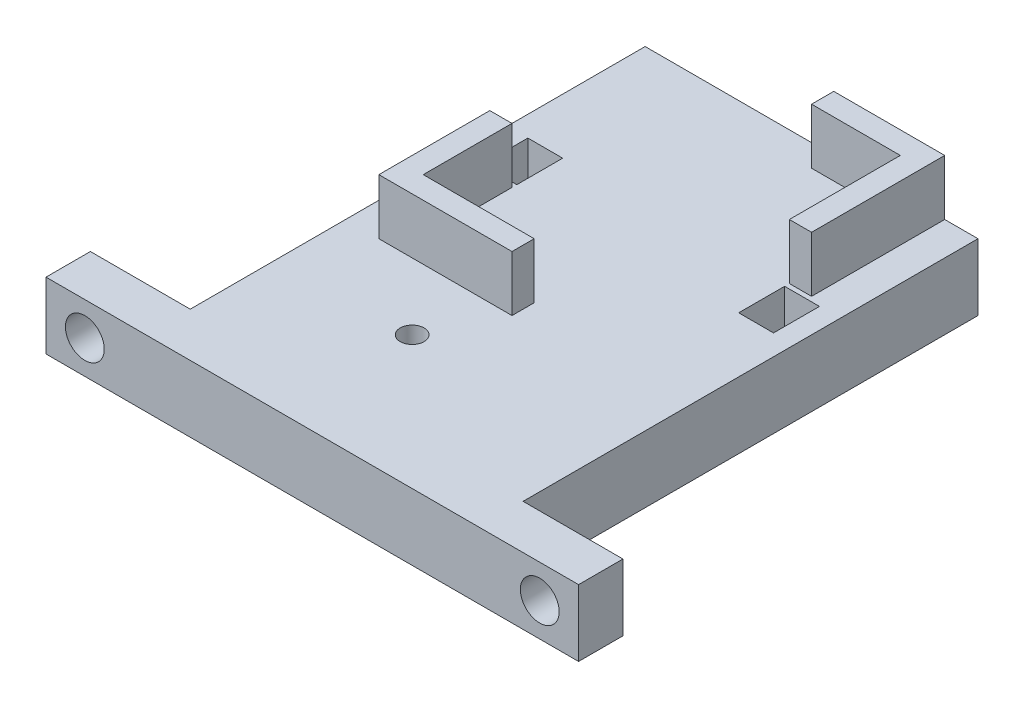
ISO-10303-21;
HEADER;
FILE_DESCRIPTION(('STEP AP214'),'2;1');
FILE_NAME('part.step','',(''),(''),'','','');
FILE_SCHEMA(('AUTOMOTIVE_DESIGN { 1 0 10303 214 1 1 1 1 }'));
ENDSEC;
DATA;
#1=APPLICATION_CONTEXT('core data for automotive mechanical design processes');
#2=APPLICATION_PROTOCOL_DEFINITION('international standard','automotive_design',2000,#1);
#3=PRODUCT_CONTEXT('',#1,'mechanical');
#4=PRODUCT('Part','Part','',(#3));
#5=PRODUCT_RELATED_PRODUCT_CATEGORY('part','',(#4));
#6=PRODUCT_DEFINITION_FORMATION('','',#4);
#7=PRODUCT_DEFINITION_CONTEXT('part definition',#1,'design');
#8=PRODUCT_DEFINITION('design','',#6,#7);
#9=PRODUCT_DEFINITION_SHAPE('','',#8);
#10=(LENGTH_UNIT() NAMED_UNIT(*) SI_UNIT(.MILLI.,.METRE.));
#11=(NAMED_UNIT(*) PLANE_ANGLE_UNIT() SI_UNIT($,.RADIAN.));
#12=(NAMED_UNIT(*) SI_UNIT($,.STERADIAN.) SOLID_ANGLE_UNIT());
#13=UNCERTAINTY_MEASURE_WITH_UNIT(LENGTH_MEASURE(1.E-05),#10,'distance_accuracy_value','');
#14=(GEOMETRIC_REPRESENTATION_CONTEXT(3) GLOBAL_UNCERTAINTY_ASSIGNED_CONTEXT((#13)) GLOBAL_UNIT_ASSIGNED_CONTEXT((#10,
#11,#12)) REPRESENTATION_CONTEXT('',''));
#15=CARTESIAN_POINT('',(0.,0.,0.));
#16=DIRECTION('',(0.,0.,1.));
#17=DIRECTION('',(1.,0.,0.));
#18=AXIS2_PLACEMENT_3D('',#15,#16,#17);
#19=CARTESIAN_POINT('',(-15.,6.,-22.5));
#20=DIRECTION('',(1.,0.,0.));
#21=DIRECTION('',(0.,0.,-1.));
#22=AXIS2_PLACEMENT_3D('',#19,#20,#21);
#23=PLANE('',#22);
#24=DIRECTION('',(0.,0.,1.));
#25=VECTOR('',#24,1.);
#26=CARTESIAN_POINT('',(-15.,0.,-22.5));
#27=LINE('',#26,#25);
#28=CARTESIAN_POINT('',(-15.,0.,-22.5));
#29=VERTEX_POINT('',#28);
#30=CARTESIAN_POINT('',(-15.,0.,18.5));
#31=VERTEX_POINT('',#30);
#32=EDGE_CURVE('E530',#29,#31,#27,.T.);
#33=ORIENTED_EDGE('',*,*,#32,.T.);
#34=DIRECTION('',(0.,1.,0.));
#35=VECTOR('',#34,1.);
#36=CARTESIAN_POINT('',(-15.,6.,18.5));
#37=LINE('',#36,#35);
#38=CARTESIAN_POINT('',(-15.,6.,18.5));
#39=VERTEX_POINT('',#38);
#40=EDGE_CURVE('E354',#31,#39,#37,.T.);
#41=ORIENTED_EDGE('',*,*,#40,.T.);
#42=DIRECTION('',(0.,0.,1.));
#43=VECTOR('',#42,1.);
#44=CARTESIAN_POINT('',(-15.,6.,-22.5));
#45=LINE('',#44,#43);
#46=CARTESIAN_POINT('',(-15.,6.,-22.5));
#47=VERTEX_POINT('',#46);
#48=EDGE_CURVE('E531',#47,#39,#45,.T.);
#49=ORIENTED_EDGE('',*,*,#48,.F.);
#50=DIRECTION('',(0.,-1.,0.));
#51=VECTOR('',#50,1.);
#52=CARTESIAN_POINT('',(-15.,6.,-22.5));
#53=LINE('',#52,#51);
#54=EDGE_CURVE('E55',#47,#29,#53,.T.);
#55=ORIENTED_EDGE('',*,*,#54,.T.);
#56=EDGE_LOOP('',(#33,#41,#49,#55));
#57=FACE_BOUND('',#56,.T.);
#58=ADVANCED_FACE('F47',(#57),#23,.F.);
#59=CARTESIAN_POINT('',(-15.,6.,22.5));
#60=DIRECTION('',(0.,0.,-1.));
#61=DIRECTION('',(-1.,0.,0.));
#62=AXIS2_PLACEMENT_3D('',#59,#60,#61);
#63=PLANE('',#62);
#64=DIRECTION('',(1.,0.,0.));
#65=VECTOR('',#64,1.);
#66=CARTESIAN_POINT('',(-15.,0.,22.5));
#67=LINE('',#66,#65);
#68=CARTESIAN_POINT('',(-24.,0.,22.5));
#69=VERTEX_POINT('',#68);
#70=CARTESIAN_POINT('',(24.,0.,22.5));
#71=VERTEX_POINT('',#70);
#72=EDGE_CURVE('E545',#69,#71,#67,.T.);
#73=ORIENTED_EDGE('',*,*,#72,.T.);
#74=DIRECTION('',(0.,1.,0.));
#75=VECTOR('',#74,1.);
#76=CARTESIAN_POINT('',(24.,6.,22.5));
#77=LINE('',#76,#75);
#78=CARTESIAN_POINT('',(24.,6.,22.5));
#79=VERTEX_POINT('',#78);
#80=EDGE_CURVE('E330',#71,#79,#77,.T.);
#81=ORIENTED_EDGE('',*,*,#80,.T.);
#82=DIRECTION('',(1.,0.,0.));
#83=VECTOR('',#82,1.);
#84=CARTESIAN_POINT('',(-15.,6.,22.5));
#85=LINE('',#84,#83);
#86=CARTESIAN_POINT('',(-24.,6.,22.5));
#87=VERTEX_POINT('',#86);
#88=EDGE_CURVE('E534',#87,#79,#85,.T.);
#89=ORIENTED_EDGE('',*,*,#88,.F.);
#90=DIRECTION('',(0.,-1.,0.));
#91=VECTOR('',#90,1.);
#92=CARTESIAN_POINT('',(-24.,6.,22.5));
#93=LINE('',#92,#91);
#94=EDGE_CURVE('E351',#87,#69,#93,.T.);
#95=ORIENTED_EDGE('',*,*,#94,.T.);
#96=EDGE_LOOP('',(#73,#81,#89,#95));
#97=FACE_BOUND('',#96,.T.);
#98=CARTESIAN_POINT('',(-20.5,3.,22.5));
#99=DIRECTION('',(0.,0.,1.));
#100=DIRECTION('',(1.,0.,0.));
#101=AXIS2_PLACEMENT_3D('',#98,#99,#100);
#102=CIRCLE('',#101,1.75);
#103=CARTESIAN_POINT('',(-18.75,3.,22.5));
#104=VERTEX_POINT('',#103);
#105=EDGE_CURVE('E345',#104,#104,#102,.T.);
#106=ORIENTED_EDGE('',*,*,#105,.F.);
#107=EDGE_LOOP('',(#106));
#108=FACE_BOUND('',#107,.T.);
#109=CARTESIAN_POINT('',(20.5,3.,22.5));
#110=DIRECTION('',(0.,0.,1.));
#111=DIRECTION('',(-1.,0.,0.));
#112=AXIS2_PLACEMENT_3D('',#109,#110,#111);
#113=CIRCLE('',#112,1.75);
#114=CARTESIAN_POINT('',(18.75,3.,22.5));
#115=VERTEX_POINT('',#114);
#116=EDGE_CURVE('E342',#115,#115,#113,.T.);
#117=ORIENTED_EDGE('',*,*,#116,.F.);
#118=EDGE_LOOP('',(#117));
#119=FACE_BOUND('',#118,.T.);
#120=ADVANCED_FACE('F593',(#97,#108,#119),#63,.F.);
#121=CARTESIAN_POINT('',(15.,6.,-22.5));
#122=DIRECTION('',(-1.,0.,0.));
#123=DIRECTION('',(0.,0.,1.));
#124=AXIS2_PLACEMENT_3D('',#121,#122,#123);
#125=PLANE('',#124);
#126=DIRECTION('',(0.,0.,-1.));
#127=VECTOR('',#126,1.);
#128=CARTESIAN_POINT('',(15.,6.,-22.5));
#129=LINE('',#128,#127);
#130=CARTESIAN_POINT('',(15.,6.,18.5));
#131=VERTEX_POINT('',#130);
#132=CARTESIAN_POINT('',(15.,6.,-22.5));
#133=VERTEX_POINT('',#132);
#134=EDGE_CURVE('E537',#131,#133,#129,.T.);
#135=ORIENTED_EDGE('',*,*,#134,.F.);
#136=DIRECTION('',(0.,-1.,0.));
#137=VECTOR('',#136,1.);
#138=CARTESIAN_POINT('',(15.,6.,18.5));
#139=LINE('',#138,#137);
#140=CARTESIAN_POINT('',(15.,0.,18.5));
#141=VERTEX_POINT('',#140);
#142=EDGE_CURVE('E334',#131,#141,#139,.T.);
#143=ORIENTED_EDGE('',*,*,#142,.T.);
#144=DIRECTION('',(0.,0.,-1.));
#145=VECTOR('',#144,1.);
#146=CARTESIAN_POINT('',(15.,0.,-22.5));
#147=LINE('',#146,#145);
#148=CARTESIAN_POINT('',(15.,0.,-22.5));
#149=VERTEX_POINT('',#148);
#150=EDGE_CURVE('E547',#141,#149,#147,.T.);
#151=ORIENTED_EDGE('',*,*,#150,.T.);
#152=DIRECTION('',(0.,-1.,0.));
#153=VECTOR('',#152,1.);
#154=CARTESIAN_POINT('',(15.,6.,-22.5));
#155=LINE('',#154,#153);
#156=EDGE_CURVE('E11',#133,#149,#155,.T.);
#157=ORIENTED_EDGE('',*,*,#156,.F.);
#158=EDGE_LOOP('',(#135,#143,#151,#157));
#159=FACE_BOUND('',#158,.T.);
#160=ADVANCED_FACE('F588',(#159),#125,.F.);
#161=CARTESIAN_POINT('',(-15.,6.,-22.5));
#162=DIRECTION('',(0.,0.,1.));
#163=DIRECTION('',(1.,0.,0.));
#164=AXIS2_PLACEMENT_3D('',#161,#162,#163);
#165=PLANE('',#164);
#166=DIRECTION('',(-1.,0.,0.));
#167=VECTOR('',#166,1.);
#168=CARTESIAN_POINT('',(-15.,0.,-22.5));
#169=LINE('',#168,#167);
#170=EDGE_CURVE('E535',#149,#29,#169,.T.);
#171=ORIENTED_EDGE('',*,*,#170,.T.);
#172=ORIENTED_EDGE('',*,*,#54,.F.);
#173=DIRECTION('',(-1.,0.,0.));
#174=VECTOR('',#173,1.);
#175=CARTESIAN_POINT('',(-15.,6.,-22.5));
#176=LINE('',#175,#174);
#177=CARTESIAN_POINT('',(1.99999999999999,6.,-22.5));
#178=VERTEX_POINT('',#177);
#179=EDGE_CURVE('E539',#178,#47,#176,.T.);
#180=ORIENTED_EDGE('',*,*,#179,.F.);
#181=DIRECTION('',(0.,-1.,0.));
#182=VECTOR('',#181,1.);
#183=CARTESIAN_POINT('',(1.99999999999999,11.,-22.5));
#184=LINE('',#183,#182);
#185=CARTESIAN_POINT('',(1.99999999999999,11.,-22.5));
#186=VERTEX_POINT('',#185);
#187=EDGE_CURVE('E469',#186,#178,#184,.T.);
#188=ORIENTED_EDGE('',*,*,#187,.F.);
#189=DIRECTION('',(-1.,0.,0.));
#190=VECTOR('',#189,1.);
#191=CARTESIAN_POINT('',(0.,11.,-22.5));
#192=LINE('',#191,#190);
#193=CARTESIAN_POINT('',(12.,11.,-22.5));
#194=VERTEX_POINT('',#193);
#195=EDGE_CURVE('E471',#194,#186,#192,.T.);
#196=ORIENTED_EDGE('',*,*,#195,.F.);
#197=DIRECTION('',(0.,-1.,0.));
#198=VECTOR('',#197,1.);
#199=CARTESIAN_POINT('',(12.,11.,-22.5));
#200=LINE('',#199,#198);
#201=CARTESIAN_POINT('',(12.,6.,-22.5));
#202=VERTEX_POINT('',#201);
#203=EDGE_CURVE('E466',#194,#202,#200,.T.);
#204=ORIENTED_EDGE('',*,*,#203,.T.);
#205=EDGE_CURVE('E540',#133,#202,#176,.T.);
#206=ORIENTED_EDGE('',*,*,#205,.F.);
#207=ORIENTED_EDGE('',*,*,#156,.T.);
#208=EDGE_LOOP('',(#171,#172,#180,#188,#196,#204,#206,#207));
#209=FACE_BOUND('',#208,.T.);
#210=ADVANCED_FACE('F570',(#209),#165,.F.);
#211=CARTESIAN_POINT('',(0.,6.,0.));
#212=DIRECTION('',(0.,1.,0.));
#213=DIRECTION('',(0.,0.,1.));
#214=AXIS2_PLACEMENT_3D('',#211,#212,#213);
#215=PLANE('',#214);
#216=CARTESIAN_POINT('',(-3.,6.,10.5));
#217=DIRECTION('',(0.,1.,0.));
#218=DIRECTION('',(0.,0.,1.));
#219=AXIS2_PLACEMENT_3D('',#216,#217,#218);
#220=CIRCLE('',#219,1.075);
#221=CARTESIAN_POINT('',(-3.,6.,11.575));
#222=VERTEX_POINT('',#221);
#223=EDGE_CURVE('E50',#222,#222,#220,.T.);
#224=ORIENTED_EDGE('',*,*,#223,.F.);
#225=EDGE_LOOP('',(#224));
#226=FACE_BOUND('',#225,.T.);
#227=DIRECTION('',(0.,0.,1.));
#228=VECTOR('',#227,1.);
#229=CARTESIAN_POINT('',(-13.14,6.,-5.92999999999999));
#230=LINE('',#229,#228);
#231=CARTESIAN_POINT('',(-13.14,6.,-10.07));
#232=VERTEX_POINT('',#231);
#233=CARTESIAN_POINT('',(-13.14,6.,-5.92999999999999));
#234=VERTEX_POINT('',#233);
#235=EDGE_CURVE('E389',#232,#234,#230,.T.);
#236=ORIENTED_EDGE('',*,*,#235,.F.);
#237=DIRECTION('',(-1.,0.,0.));
#238=VECTOR('',#237,1.);
#239=CARTESIAN_POINT('',(-13.14,6.,-10.07));
#240=LINE('',#239,#238);
#241=CARTESIAN_POINT('',(-10.,6.,-10.07));
#242=VERTEX_POINT('',#241);
#243=EDGE_CURVE('E379',#242,#232,#240,.T.);
#244=ORIENTED_EDGE('',*,*,#243,.F.);
#245=DIRECTION('',(0.,0.,-1.));
#246=VECTOR('',#245,1.);
#247=CARTESIAN_POINT('',(-10.,6.,-5.92999999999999));
#248=LINE('',#247,#246);
#249=CARTESIAN_POINT('',(-10.,6.,-5.92999999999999));
#250=VERTEX_POINT('',#249);
#251=EDGE_CURVE('E395',#250,#242,#248,.T.);
#252=ORIENTED_EDGE('',*,*,#251,.F.);
#253=DIRECTION('',(1.,0.,0.));
#254=VECTOR('',#253,1.);
#255=CARTESIAN_POINT('',(-13.14,6.,-5.92999999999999));
#256=LINE('',#255,#254);
#257=EDGE_CURVE('E391',#234,#250,#256,.T.);
#258=ORIENTED_EDGE('',*,*,#257,.F.);
#259=EDGE_LOOP('',(#236,#244,#252,#258));
#260=FACE_BOUND('',#259,.T.);
#261=DIRECTION('',(0.,0.,-1.));
#262=VECTOR('',#261,1.);
#263=CARTESIAN_POINT('',(13.14,6.,-5.92999999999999));
#264=LINE('',#263,#262);
#265=CARTESIAN_POINT('',(13.14,6.,-5.92999999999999));
#266=VERTEX_POINT('',#265);
#267=CARTESIAN_POINT('',(13.14,6.,-10.07));
#268=VERTEX_POINT('',#267);
#269=EDGE_CURVE('E392',#266,#268,#264,.T.);
#270=ORIENTED_EDGE('',*,*,#269,.F.);
#271=DIRECTION('',(1.,0.,0.));
#272=VECTOR('',#271,1.);
#273=CARTESIAN_POINT('',(13.14,6.,-5.92999999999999));
#274=LINE('',#273,#272);
#275=CARTESIAN_POINT('',(10.,6.,-5.92999999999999));
#276=VERTEX_POINT('',#275);
#277=EDGE_CURVE('E418',#276,#266,#274,.T.);
#278=ORIENTED_EDGE('',*,*,#277,.F.);
#279=DIRECTION('',(0.,0.,1.));
#280=VECTOR('',#279,1.);
#281=CARTESIAN_POINT('',(10.,6.,-5.92999999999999));
#282=LINE('',#281,#280);
#283=CARTESIAN_POINT('',(10.,6.,-10.07));
#284=VERTEX_POINT('',#283);
#285=EDGE_CURVE('E421',#284,#276,#282,.T.);
#286=ORIENTED_EDGE('',*,*,#285,.F.);
#287=DIRECTION('',(-1.,0.,0.));
#288=VECTOR('',#287,1.);
#289=CARTESIAN_POINT('',(13.14,6.,-10.07));
#290=LINE('',#289,#288);
#291=EDGE_CURVE('E425',#268,#284,#290,.T.);
#292=ORIENTED_EDGE('',*,*,#291,.F.);
#293=EDGE_LOOP('',(#270,#278,#286,#292));
#294=FACE_BOUND('',#293,.T.);
#295=DIRECTION('',(0.,0.,-1.));
#296=VECTOR('',#295,1.);
#297=CARTESIAN_POINT('',(1.99999999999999,6.,0.));
#298=LINE('',#297,#296);
#299=CARTESIAN_POINT('',(1.99999999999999,6.,-20.5));
#300=VERTEX_POINT('',#299);
#301=EDGE_CURVE('E445',#300,#178,#298,.T.);
#302=ORIENTED_EDGE('',*,*,#301,.T.);
#303=ORIENTED_EDGE('',*,*,#179,.T.);
#304=ORIENTED_EDGE('',*,*,#48,.T.);
#305=DIRECTION('',(-1.,0.,0.));
#306=VECTOR('',#305,1.);
#307=CARTESIAN_POINT('',(-15.,6.,18.5));
#308=LINE('',#307,#306);
#309=CARTESIAN_POINT('',(-24.,6.,18.5));
#310=VERTEX_POINT('',#309);
#311=EDGE_CURVE('E357',#39,#310,#308,.T.);
#312=ORIENTED_EDGE('',*,*,#311,.T.);
#313=DIRECTION('',(0.,0.,1.));
#314=VECTOR('',#313,1.);
#315=CARTESIAN_POINT('',(-24.,6.,18.5));
#316=LINE('',#315,#314);
#317=EDGE_CURVE('E366',#310,#87,#316,.T.);
#318=ORIENTED_EDGE('',*,*,#317,.T.);
#319=ORIENTED_EDGE('',*,*,#88,.T.);
#320=DIRECTION('',(0.,0.,1.));
#321=VECTOR('',#320,1.);
#322=CARTESIAN_POINT('',(24.,6.,18.5));
#323=LINE('',#322,#321);
#324=CARTESIAN_POINT('',(24.,6.,18.5));
#325=VERTEX_POINT('',#324);
#326=EDGE_CURVE('E316',#325,#79,#323,.T.);
#327=ORIENTED_EDGE('',*,*,#326,.F.);
#328=DIRECTION('',(-1.,0.,0.));
#329=VECTOR('',#328,1.);
#330=CARTESIAN_POINT('',(15.,6.,18.5));
#331=LINE('',#330,#329);
#332=EDGE_CURVE('E327',#325,#131,#331,.T.);
#333=ORIENTED_EDGE('',*,*,#332,.T.);
#334=ORIENTED_EDGE('',*,*,#134,.T.);
#335=ORIENTED_EDGE('',*,*,#205,.T.);
#336=DIRECTION('',(0.,0.,1.));
#337=VECTOR('',#336,1.);
#338=CARTESIAN_POINT('',(12.,6.,-20.5));
#339=LINE('',#338,#337);
#340=CARTESIAN_POINT('',(12.,6.,-10.5));
#341=VERTEX_POINT('',#340);
#342=EDGE_CURVE('E448',#202,#341,#339,.T.);
#343=ORIENTED_EDGE('',*,*,#342,.T.);
#344=DIRECTION('',(-1.,0.,0.));
#345=VECTOR('',#344,1.);
#346=CARTESIAN_POINT('',(12.,6.,-10.5));
#347=LINE('',#346,#345);
#348=CARTESIAN_POINT('',(10.,6.,-10.5));
#349=VERTEX_POINT('',#348);
#350=EDGE_CURVE('E451',#341,#349,#347,.T.);
#351=ORIENTED_EDGE('',*,*,#350,.T.);
#352=DIRECTION('',(0.,0.,1.));
#353=VECTOR('',#352,1.);
#354=CARTESIAN_POINT('',(9.99999999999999,6.,-20.5));
#355=LINE('',#354,#353);
#356=CARTESIAN_POINT('',(9.99999999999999,6.,-20.5));
#357=VERTEX_POINT('',#356);
#358=EDGE_CURVE('E455',#357,#349,#355,.T.);
#359=ORIENTED_EDGE('',*,*,#358,.F.);
#360=DIRECTION('',(-1.,0.,0.));
#361=VECTOR('',#360,1.);
#362=CARTESIAN_POINT('',(0.,6.,-20.5));
#363=LINE('',#362,#361);
#364=EDGE_CURVE('E472',#357,#300,#363,.T.);
#365=ORIENTED_EDGE('',*,*,#364,.T.);
#366=EDGE_LOOP('',(#302,#303,#304,#312,#318,#319,#327,#333,#334,#335,#343,#351,#359,#365));
#367=FACE_BOUND('',#366,.T.);
#368=DIRECTION('',(0.,0.,1.));
#369=VECTOR('',#368,1.);
#370=CARTESIAN_POINT('',(-10.,6.,0.));
#371=LINE('',#370,#369);
#372=CARTESIAN_POINT('',(-10.,6.,-5.49999999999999));
#373=VERTEX_POINT('',#372);
#374=CARTESIAN_POINT('',(-10.,6.,2.50000000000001));
#375=VERTEX_POINT('',#374);
#376=EDGE_CURVE('E458',#373,#375,#371,.T.);
#377=ORIENTED_EDGE('',*,*,#376,.T.);
#378=DIRECTION('',(1.,0.,0.));
#379=VECTOR('',#378,1.);
#380=CARTESIAN_POINT('',(0.,6.,2.50000000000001));
#381=LINE('',#380,#379);
#382=CARTESIAN_POINT('',(0.,6.,2.50000000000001));
#383=VERTEX_POINT('',#382);
#384=EDGE_CURVE('E487',#375,#383,#381,.T.);
#385=ORIENTED_EDGE('',*,*,#384,.T.);
#386=DIRECTION('',(0.,0.,1.));
#387=VECTOR('',#386,1.);
#388=CARTESIAN_POINT('',(0.,6.,0.));
#389=LINE('',#388,#387);
#390=CARTESIAN_POINT('',(0.,6.,4.50000000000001));
#391=VERTEX_POINT('',#390);
#392=EDGE_CURVE('E510',#383,#391,#389,.T.);
#393=ORIENTED_EDGE('',*,*,#392,.T.);
#394=DIRECTION('',(1.,0.,0.));
#395=VECTOR('',#394,1.);
#396=CARTESIAN_POINT('',(0.,6.,4.50000000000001));
#397=LINE('',#396,#395);
#398=CARTESIAN_POINT('',(-12.,6.,4.50000000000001));
#399=VERTEX_POINT('',#398);
#400=EDGE_CURVE('E507',#399,#391,#397,.T.);
#401=ORIENTED_EDGE('',*,*,#400,.F.);
#402=DIRECTION('',(0.,0.,1.));
#403=VECTOR('',#402,1.);
#404=CARTESIAN_POINT('',(-12.,6.,0.));
#405=LINE('',#404,#403);
#406=CARTESIAN_POINT('',(-12.,6.,-5.49999999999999));
#407=VERTEX_POINT('',#406);
#408=EDGE_CURVE('E504',#407,#399,#405,.T.);
#409=ORIENTED_EDGE('',*,*,#408,.F.);
#410=DIRECTION('',(1.,0.,0.));
#411=VECTOR('',#410,1.);
#412=CARTESIAN_POINT('',(0.,6.,-5.49999999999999));
#413=LINE('',#412,#411);
#414=EDGE_CURVE('E502',#407,#373,#413,.T.);
#415=ORIENTED_EDGE('',*,*,#414,.T.);
#416=EDGE_LOOP('',(#377,#385,#393,#401,#409,#415));
#417=FACE_BOUND('',#416,.T.);
#418=ADVANCED_FACE('F566',(#226,#260,#294,#367,#417),#215,.T.);
#419=CARTESIAN_POINT('',(0.,0.,0.));
#420=DIRECTION('',(0.,1.,0.));
#421=DIRECTION('',(0.,0.,1.));
#422=AXIS2_PLACEMENT_3D('',#419,#420,#421);
#423=PLANE('',#422);
#424=DIRECTION('',(0.,0.,-1.));
#425=VECTOR('',#424,1.);
#426=CARTESIAN_POINT('',(-5.075,0.,11.6980018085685));
#427=LINE('',#426,#425);
#428=CARTESIAN_POINT('',(-5.075,0.,11.6980018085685));
#429=VERTEX_POINT('',#428);
#430=CARTESIAN_POINT('',(-5.07499999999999,0.,9.30199819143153));
#431=VERTEX_POINT('',#430);
#432=EDGE_CURVE('E304',#429,#431,#427,.T.);
#433=ORIENTED_EDGE('',*,*,#432,.F.);
#434=DIRECTION('',(-0.866025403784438,0.,-0.500000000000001));
#435=VECTOR('',#434,1.);
#436=CARTESIAN_POINT('',(-3.,0.,12.8960036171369));
#437=LINE('',#436,#435);
#438=CARTESIAN_POINT('',(-3.,0.,12.8960036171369));
#439=VERTEX_POINT('',#438);
#440=EDGE_CURVE('E62',#439,#429,#437,.T.);
#441=ORIENTED_EDGE('',*,*,#440,.F.);
#442=DIRECTION('',(0.86602540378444,0.,-0.499999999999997));
#443=VECTOR('',#442,1.);
#444=CARTESIAN_POINT('',(-3.,0.,12.8960036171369));
#445=LINE('',#444,#443);
#446=CARTESIAN_POINT('',(-0.925000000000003,0.,11.6980018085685));
#447=VERTEX_POINT('',#446);
#448=EDGE_CURVE('E289',#439,#447,#445,.T.);
#449=ORIENTED_EDGE('',*,*,#448,.T.);
#450=DIRECTION('',(0.,0.,-1.));
#451=VECTOR('',#450,1.);
#452=CARTESIAN_POINT('',(-0.925000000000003,0.,11.6980018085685));
#453=LINE('',#452,#451);
#454=CARTESIAN_POINT('',(-0.925000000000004,0.,9.30199819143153));
#455=VERTEX_POINT('',#454);
#456=EDGE_CURVE('E292',#447,#455,#453,.T.);
#457=ORIENTED_EDGE('',*,*,#456,.T.);
#458=DIRECTION('',(-0.866025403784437,0.,-0.500000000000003));
#459=VECTOR('',#458,1.);
#460=CARTESIAN_POINT('',(-0.925000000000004,0.,9.30199819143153));
#461=LINE('',#460,#459);
#462=CARTESIAN_POINT('',(-2.99999999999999,0.,8.10399638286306));
#463=VERTEX_POINT('',#462);
#464=EDGE_CURVE('E309',#455,#463,#461,.T.);
#465=ORIENTED_EDGE('',*,*,#464,.T.);
#466=DIRECTION('',(0.866025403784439,0.,-0.499999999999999));
#467=VECTOR('',#466,1.);
#468=CARTESIAN_POINT('',(-5.07499999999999,0.,9.30199819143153));
#469=LINE('',#468,#467);
#470=EDGE_CURVE('E306',#431,#463,#469,.T.);
#471=ORIENTED_EDGE('',*,*,#470,.F.);
#472=EDGE_LOOP('',(#433,#441,#449,#457,#465,#471));
#473=FACE_BOUND('',#472,.T.);
#474=DIRECTION('',(-1.,0.,0.));
#475=VECTOR('',#474,1.);
#476=CARTESIAN_POINT('',(-13.14,0.,-10.07));
#477=LINE('',#476,#475);
#478=CARTESIAN_POINT('',(-10.,0.,-10.07));
#479=VERTEX_POINT('',#478);
#480=CARTESIAN_POINT('',(-13.14,0.,-10.07));
#481=VERTEX_POINT('',#480);
#482=EDGE_CURVE('E385',#479,#481,#477,.T.);
#483=ORIENTED_EDGE('',*,*,#482,.T.);
#484=DIRECTION('',(0.,0.,1.));
#485=VECTOR('',#484,1.);
#486=CARTESIAN_POINT('',(-13.14,0.,-5.92999999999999));
#487=LINE('',#486,#485);
#488=CARTESIAN_POINT('',(-13.14,0.,-5.92999999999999));
#489=VERTEX_POINT('',#488);
#490=EDGE_CURVE('E375',#481,#489,#487,.T.);
#491=ORIENTED_EDGE('',*,*,#490,.T.);
#492=DIRECTION('',(1.,0.,0.));
#493=VECTOR('',#492,1.);
#494=CARTESIAN_POINT('',(-13.14,0.,-5.92999999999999));
#495=LINE('',#494,#493);
#496=CARTESIAN_POINT('',(-10.,0.,-5.92999999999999));
#497=VERTEX_POINT('',#496);
#498=EDGE_CURVE('E378',#489,#497,#495,.T.);
#499=ORIENTED_EDGE('',*,*,#498,.T.);
#500=DIRECTION('',(0.,0.,-1.));
#501=VECTOR('',#500,1.);
#502=CARTESIAN_POINT('',(-10.,0.,-5.92999999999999));
#503=LINE('',#502,#501);
#504=EDGE_CURVE('E382',#497,#479,#503,.T.);
#505=ORIENTED_EDGE('',*,*,#504,.T.);
#506=EDGE_LOOP('',(#483,#491,#499,#505));
#507=FACE_BOUND('',#506,.T.);
#508=DIRECTION('',(1.,0.,0.));
#509=VECTOR('',#508,1.);
#510=CARTESIAN_POINT('',(13.14,0.,-5.92999999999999));
#511=LINE('',#510,#509);
#512=CARTESIAN_POINT('',(10.,0.,-5.92999999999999));
#513=VERTEX_POINT('',#512);
#514=CARTESIAN_POINT('',(13.14,0.,-5.92999999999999));
#515=VERTEX_POINT('',#514);
#516=EDGE_CURVE('E412',#513,#515,#511,.T.);
#517=ORIENTED_EDGE('',*,*,#516,.T.);
#518=DIRECTION('',(0.,0.,-1.));
#519=VECTOR('',#518,1.);
#520=CARTESIAN_POINT('',(13.14,0.,-5.92999999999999));
#521=LINE('',#520,#519);
#522=CARTESIAN_POINT('',(13.14,0.,-10.07));
#523=VERTEX_POINT('',#522);
#524=EDGE_CURVE('E422',#515,#523,#521,.T.);
#525=ORIENTED_EDGE('',*,*,#524,.T.);
#526=DIRECTION('',(-1.,0.,0.));
#527=VECTOR('',#526,1.);
#528=CARTESIAN_POINT('',(13.14,0.,-10.07));
#529=LINE('',#528,#527);
#530=CARTESIAN_POINT('',(10.,0.,-10.07));
#531=VERTEX_POINT('',#530);
#532=EDGE_CURVE('E434',#523,#531,#529,.T.);
#533=ORIENTED_EDGE('',*,*,#532,.T.);
#534=DIRECTION('',(0.,0.,1.));
#535=VECTOR('',#534,1.);
#536=CARTESIAN_POINT('',(10.,0.,-5.92999999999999));
#537=LINE('',#536,#535);
#538=EDGE_CURVE('E431',#531,#513,#537,.T.);
#539=ORIENTED_EDGE('',*,*,#538,.T.);
#540=EDGE_LOOP('',(#517,#525,#533,#539));
#541=FACE_BOUND('',#540,.T.);
#542=ORIENTED_EDGE('',*,*,#32,.F.);
#543=ORIENTED_EDGE('',*,*,#170,.F.);
#544=ORIENTED_EDGE('',*,*,#150,.F.);
#545=DIRECTION('',(1.,0.,0.));
#546=VECTOR('',#545,1.);
#547=CARTESIAN_POINT('',(15.,0.,18.5));
#548=LINE('',#547,#546);
#549=CARTESIAN_POINT('',(24.,0.,18.5));
#550=VERTEX_POINT('',#549);
#551=EDGE_CURVE('E70',#141,#550,#548,.T.);
#552=ORIENTED_EDGE('',*,*,#551,.T.);
#553=DIRECTION('',(0.,0.,1.));
#554=VECTOR('',#553,1.);
#555=CARTESIAN_POINT('',(24.,0.,18.5));
#556=LINE('',#555,#554);
#557=EDGE_CURVE('E324',#550,#71,#556,.T.);
#558=ORIENTED_EDGE('',*,*,#557,.T.);
#559=ORIENTED_EDGE('',*,*,#72,.F.);
#560=DIRECTION('',(0.,0.,1.));
#561=VECTOR('',#560,1.);
#562=CARTESIAN_POINT('',(-24.,0.,18.5));
#563=LINE('',#562,#561);
#564=CARTESIAN_POINT('',(-24.,0.,18.5));
#565=VERTEX_POINT('',#564);
#566=EDGE_CURVE('E369',#565,#69,#563,.T.);
#567=ORIENTED_EDGE('',*,*,#566,.F.);
#568=DIRECTION('',(1.,0.,0.));
#569=VECTOR('',#568,1.);
#570=CARTESIAN_POINT('',(-15.,0.,18.5));
#571=LINE('',#570,#569);
#572=EDGE_CURVE('E363',#565,#31,#571,.T.);
#573=ORIENTED_EDGE('',*,*,#572,.T.);
#574=EDGE_LOOP('',(#542,#543,#544,#552,#558,#559,#567,#573));
#575=FACE_BOUND('',#574,.T.);
#576=ADVANCED_FACE('F559',(#473,#507,#541,#575),#423,.F.);
#577=CARTESIAN_POINT('',(-10.,11.,0.));
#578=DIRECTION('',(1.,0.,0.));
#579=DIRECTION('',(0.,0.,-1.));
#580=AXIS2_PLACEMENT_3D('',#577,#578,#579);
#581=PLANE('',#580);
#582=ORIENTED_EDGE('',*,*,#376,.F.);
#583=DIRECTION('',(0.,-1.,0.));
#584=VECTOR('',#583,1.);
#585=CARTESIAN_POINT('',(-10.,11.,-5.49999999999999));
#586=LINE('',#585,#584);
#587=CARTESIAN_POINT('',(-10.,11.,-5.49999999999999));
#588=VERTEX_POINT('',#587);
#589=EDGE_CURVE('E527',#588,#373,#586,.T.);
#590=ORIENTED_EDGE('',*,*,#589,.F.);
#591=DIRECTION('',(0.,0.,1.));
#592=VECTOR('',#591,1.);
#593=CARTESIAN_POINT('',(-10.,11.,0.));
#594=LINE('',#593,#592);
#595=CARTESIAN_POINT('',(-10.,11.,2.50000000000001));
#596=VERTEX_POINT('',#595);
#597=EDGE_CURVE('E483',#588,#596,#594,.T.);
#598=ORIENTED_EDGE('',*,*,#597,.T.);
#599=DIRECTION('',(0.,-1.,0.));
#600=VECTOR('',#599,1.);
#601=CARTESIAN_POINT('',(-10.,11.,2.50000000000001));
#602=LINE('',#601,#600);
#603=EDGE_CURVE('E500',#596,#375,#602,.T.);
#604=ORIENTED_EDGE('',*,*,#603,.T.);
#605=EDGE_LOOP('',(#582,#590,#598,#604));
#606=FACE_BOUND('',#605,.T.);
#607=ADVANCED_FACE('F625',(#606),#581,.T.);
#608=CARTESIAN_POINT('',(0.,11.,-5.49999999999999));
#609=DIRECTION('',(0.,0.,-1.));
#610=DIRECTION('',(-1.,0.,0.));
#611=AXIS2_PLACEMENT_3D('',#608,#609,#610);
#612=PLANE('',#611);
#613=ORIENTED_EDGE('',*,*,#414,.F.);
#614=DIRECTION('',(0.,-1.,0.));
#615=VECTOR('',#614,1.);
#616=CARTESIAN_POINT('',(-12.,11.,-5.49999999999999));
#617=LINE('',#616,#615);
#618=CARTESIAN_POINT('',(-12.,11.,-5.49999999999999));
#619=VERTEX_POINT('',#618);
#620=EDGE_CURVE('E524',#619,#407,#617,.T.);
#621=ORIENTED_EDGE('',*,*,#620,.F.);
#622=DIRECTION('',(1.,0.,0.));
#623=VECTOR('',#622,1.);
#624=CARTESIAN_POINT('',(0.,11.,-5.49999999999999));
#625=LINE('',#624,#623);
#626=EDGE_CURVE('E486',#619,#588,#625,.T.);
#627=ORIENTED_EDGE('',*,*,#626,.T.);
#628=ORIENTED_EDGE('',*,*,#589,.T.);
#629=EDGE_LOOP('',(#613,#621,#627,#628));
#630=FACE_BOUND('',#629,.T.);
#631=ADVANCED_FACE('F632',(#630),#612,.T.);
#632=CARTESIAN_POINT('',(-12.,11.,0.));
#633=DIRECTION('',(1.,0.,0.));
#634=DIRECTION('',(0.,0.,-1.));
#635=AXIS2_PLACEMENT_3D('',#632,#633,#634);
#636=PLANE('',#635);
#637=ORIENTED_EDGE('',*,*,#408,.T.);
#638=DIRECTION('',(0.,-1.,0.));
#639=VECTOR('',#638,1.);
#640=CARTESIAN_POINT('',(-12.,11.,4.50000000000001));
#641=LINE('',#640,#639);
#642=CARTESIAN_POINT('',(-12.,11.,4.50000000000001));
#643=VERTEX_POINT('',#642);
#644=EDGE_CURVE('E521',#643,#399,#641,.T.);
#645=ORIENTED_EDGE('',*,*,#644,.F.);
#646=DIRECTION('',(0.,0.,1.));
#647=VECTOR('',#646,1.);
#648=CARTESIAN_POINT('',(-12.,11.,0.));
#649=LINE('',#648,#647);
#650=EDGE_CURVE('E490',#619,#643,#649,.T.);
#651=ORIENTED_EDGE('',*,*,#650,.F.);
#652=ORIENTED_EDGE('',*,*,#620,.T.);
#653=EDGE_LOOP('',(#637,#645,#651,#652));
#654=FACE_BOUND('',#653,.T.);
#655=ADVANCED_FACE('F636',(#654),#636,.F.);
#656=CARTESIAN_POINT('',(0.,11.,4.50000000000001));
#657=DIRECTION('',(0.,0.,-1.));
#658=DIRECTION('',(-1.,0.,0.));
#659=AXIS2_PLACEMENT_3D('',#656,#657,#658);
#660=PLANE('',#659);
#661=ORIENTED_EDGE('',*,*,#400,.T.);
#662=DIRECTION('',(0.,-1.,0.));
#663=VECTOR('',#662,1.);
#664=CARTESIAN_POINT('',(0.,11.,4.50000000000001));
#665=LINE('',#664,#663);
#666=CARTESIAN_POINT('',(0.,11.,4.50000000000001));
#667=VERTEX_POINT('',#666);
#668=EDGE_CURVE('E518',#667,#391,#665,.T.);
#669=ORIENTED_EDGE('',*,*,#668,.F.);
#670=DIRECTION('',(1.,0.,0.));
#671=VECTOR('',#670,1.);
#672=CARTESIAN_POINT('',(0.,11.,4.50000000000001));
#673=LINE('',#672,#671);
#674=EDGE_CURVE('E492',#643,#667,#673,.T.);
#675=ORIENTED_EDGE('',*,*,#674,.F.);
#676=ORIENTED_EDGE('',*,*,#644,.T.);
#677=EDGE_LOOP('',(#661,#669,#675,#676));
#678=FACE_BOUND('',#677,.T.);
#679=ADVANCED_FACE('F640',(#678),#660,.F.);
#680=CARTESIAN_POINT('',(0.,11.,0.));
#681=DIRECTION('',(1.,0.,0.));
#682=DIRECTION('',(0.,0.,-1.));
#683=AXIS2_PLACEMENT_3D('',#680,#681,#682);
#684=PLANE('',#683);
#685=ORIENTED_EDGE('',*,*,#392,.F.);
#686=DIRECTION('',(0.,-1.,0.));
#687=VECTOR('',#686,1.);
#688=CARTESIAN_POINT('',(0.,11.,2.50000000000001));
#689=LINE('',#688,#687);
#690=CARTESIAN_POINT('',(0.,11.,2.50000000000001));
#691=VERTEX_POINT('',#690);
#692=EDGE_CURVE('E515',#691,#383,#689,.T.);
#693=ORIENTED_EDGE('',*,*,#692,.F.);
#694=DIRECTION('',(0.,0.,1.));
#695=VECTOR('',#694,1.);
#696=CARTESIAN_POINT('',(0.,11.,0.));
#697=LINE('',#696,#695);
#698=EDGE_CURVE('E494',#691,#667,#697,.T.);
#699=ORIENTED_EDGE('',*,*,#698,.T.);
#700=ORIENTED_EDGE('',*,*,#668,.T.);
#701=EDGE_LOOP('',(#685,#693,#699,#700));
#702=FACE_BOUND('',#701,.T.);
#703=ADVANCED_FACE('F644',(#702),#684,.T.);
#704=CARTESIAN_POINT('',(0.,11.,2.50000000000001));
#705=DIRECTION('',(0.,0.,-1.));
#706=DIRECTION('',(-1.,0.,0.));
#707=AXIS2_PLACEMENT_3D('',#704,#705,#706);
#708=PLANE('',#707);
#709=ORIENTED_EDGE('',*,*,#384,.F.);
#710=ORIENTED_EDGE('',*,*,#603,.F.);
#711=DIRECTION('',(1.,0.,0.));
#712=VECTOR('',#711,1.);
#713=CARTESIAN_POINT('',(0.,11.,2.50000000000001));
#714=LINE('',#713,#712);
#715=EDGE_CURVE('E497',#596,#691,#714,.T.);
#716=ORIENTED_EDGE('',*,*,#715,.T.);
#717=ORIENTED_EDGE('',*,*,#692,.T.);
#718=EDGE_LOOP('',(#709,#710,#716,#717));
#719=FACE_BOUND('',#718,.T.);
#720=ADVANCED_FACE('F648',(#719),#708,.T.);
#721=CARTESIAN_POINT('',(0.,11.,0.));
#722=DIRECTION('',(0.,1.,0.));
#723=DIRECTION('',(0.,0.,1.));
#724=AXIS2_PLACEMENT_3D('',#721,#722,#723);
#725=PLANE('',#724);
#726=ORIENTED_EDGE('',*,*,#597,.F.);
#727=ORIENTED_EDGE('',*,*,#626,.F.);
#728=ORIENTED_EDGE('',*,*,#650,.T.);
#729=ORIENTED_EDGE('',*,*,#674,.T.);
#730=ORIENTED_EDGE('',*,*,#698,.F.);
#731=ORIENTED_EDGE('',*,*,#715,.F.);
#732=EDGE_LOOP('',(#726,#727,#728,#729,#730,#731));
#733=FACE_BOUND('',#732,.T.);
#734=ADVANCED_FACE('F652',(#733),#725,.T.);
#735=CARTESIAN_POINT('',(1.99999999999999,11.,0.));
#736=DIRECTION('',(-1.,0.,0.));
#737=DIRECTION('',(0.,0.,1.));
#738=AXIS2_PLACEMENT_3D('',#735,#736,#737);
#739=PLANE('',#738);
#740=ORIENTED_EDGE('',*,*,#301,.F.);
#741=DIRECTION('',(0.,-1.,0.));
#742=VECTOR('',#741,1.);
#743=CARTESIAN_POINT('',(1.99999999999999,11.,-20.5));
#744=LINE('',#743,#742);
#745=CARTESIAN_POINT('',(1.99999999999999,11.,-20.5));
#746=VERTEX_POINT('',#745);
#747=EDGE_CURVE('E441',#746,#300,#744,.T.);
#748=ORIENTED_EDGE('',*,*,#747,.F.);
#749=DIRECTION('',(0.,0.,-1.));
#750=VECTOR('',#749,1.);
#751=CARTESIAN_POINT('',(1.99999999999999,11.,0.));
#752=LINE('',#751,#750);
#753=EDGE_CURVE('E475',#746,#186,#752,.T.);
#754=ORIENTED_EDGE('',*,*,#753,.T.);
#755=ORIENTED_EDGE('',*,*,#187,.T.);
#756=EDGE_LOOP('',(#740,#748,#754,#755));
#757=FACE_BOUND('',#756,.T.);
#758=ADVANCED_FACE('F575',(#757),#739,.T.);
#759=CARTESIAN_POINT('',(0.,11.,-20.5));
#760=DIRECTION('',(0.,0.,1.));
#761=DIRECTION('',(1.,0.,0.));
#762=AXIS2_PLACEMENT_3D('',#759,#760,#761);
#763=PLANE('',#762);
#764=DIRECTION('',(0.,-1.,0.));
#765=VECTOR('',#764,1.);
#766=CARTESIAN_POINT('',(9.99999999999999,11.,-20.5));
#767=LINE('',#766,#765);
#768=CARTESIAN_POINT('',(9.99999999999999,11.,-20.5));
#769=VERTEX_POINT('',#768);
#770=EDGE_CURVE('E402',#769,#357,#767,.T.);
#771=ORIENTED_EDGE('',*,*,#770,.F.);
#772=DIRECTION('',(-1.,0.,0.));
#773=VECTOR('',#772,1.);
#774=CARTESIAN_POINT('',(0.,11.,-20.5));
#775=LINE('',#774,#773);
#776=EDGE_CURVE('E479',#769,#746,#775,.T.);
#777=ORIENTED_EDGE('',*,*,#776,.T.);
#778=ORIENTED_EDGE('',*,*,#747,.T.);
#779=ORIENTED_EDGE('',*,*,#364,.F.);
#780=EDGE_LOOP('',(#771,#777,#778,#779));
#781=FACE_BOUND('',#780,.T.);
#782=ADVANCED_FACE('F664',(#781),#763,.T.);
#783=CARTESIAN_POINT('',(12.,11.,0.));
#784=DIRECTION('',(-1.,0.,0.));
#785=DIRECTION('',(0.,0.,1.));
#786=AXIS2_PLACEMENT_3D('',#783,#784,#785);
#787=PLANE('',#786);
#788=ORIENTED_EDGE('',*,*,#342,.F.);
#789=ORIENTED_EDGE('',*,*,#203,.F.);
#790=DIRECTION('',(0.,0.,1.));
#791=VECTOR('',#790,1.);
#792=CARTESIAN_POINT('',(12.,11.,-20.5));
#793=LINE('',#792,#791);
#794=CARTESIAN_POINT('',(12.,11.,-10.5));
#795=VERTEX_POINT('',#794);
#796=EDGE_CURVE('E447',#194,#795,#793,.T.);
#797=ORIENTED_EDGE('',*,*,#796,.T.);
#798=DIRECTION('',(0.,-1.,0.));
#799=VECTOR('',#798,1.);
#800=CARTESIAN_POINT('',(12.,11.,-10.5));
#801=LINE('',#800,#799);
#802=EDGE_CURVE('E444',#795,#341,#801,.T.);
#803=ORIENTED_EDGE('',*,*,#802,.T.);
#804=EDGE_LOOP('',(#788,#789,#797,#803));
#805=FACE_BOUND('',#804,.T.);
#806=ADVANCED_FACE('F582',(#805),#787,.F.);
#807=CARTESIAN_POINT('',(0.,11.,0.));
#808=DIRECTION('',(0.,1.,0.));
#809=DIRECTION('',(0.,0.,1.));
#810=AXIS2_PLACEMENT_3D('',#807,#808,#809);
#811=PLANE('',#810);
#812=ORIENTED_EDGE('',*,*,#753,.F.);
#813=ORIENTED_EDGE('',*,*,#776,.F.);
#814=DIRECTION('',(0.,0.,1.));
#815=VECTOR('',#814,1.);
#816=CARTESIAN_POINT('',(9.99999999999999,11.,-20.5));
#817=LINE('',#816,#815);
#818=CARTESIAN_POINT('',(10.,11.,-10.5));
#819=VERTEX_POINT('',#818);
#820=EDGE_CURVE('E452',#769,#819,#817,.T.);
#821=ORIENTED_EDGE('',*,*,#820,.T.);
#822=DIRECTION('',(-1.,0.,0.));
#823=VECTOR('',#822,1.);
#824=CARTESIAN_POINT('',(12.,11.,-10.5));
#825=LINE('',#824,#823);
#826=EDGE_CURVE('E461',#795,#819,#825,.T.);
#827=ORIENTED_EDGE('',*,*,#826,.F.);
#828=ORIENTED_EDGE('',*,*,#796,.F.);
#829=ORIENTED_EDGE('',*,*,#195,.T.);
#830=EDGE_LOOP('',(#812,#813,#821,#827,#828,#829));
#831=FACE_BOUND('',#830,.T.);
#832=ADVANCED_FACE('F578',(#831),#811,.T.);
#833=CARTESIAN_POINT('',(12.,11.,-10.5));
#834=DIRECTION('',(0.,0.,1.));
#835=DIRECTION('',(1.,0.,0.));
#836=AXIS2_PLACEMENT_3D('',#833,#834,#835);
#837=PLANE('',#836);
#838=ORIENTED_EDGE('',*,*,#350,.F.);
#839=ORIENTED_EDGE('',*,*,#802,.F.);
#840=ORIENTED_EDGE('',*,*,#826,.T.);
#841=DIRECTION('',(0.,-1.,0.));
#842=VECTOR('',#841,1.);
#843=CARTESIAN_POINT('',(10.,11.,-10.5));
#844=LINE('',#843,#842);
#845=EDGE_CURVE('E442',#819,#349,#844,.T.);
#846=ORIENTED_EDGE('',*,*,#845,.T.);
#847=EDGE_LOOP('',(#838,#839,#840,#846));
#848=FACE_BOUND('',#847,.T.);
#849=ADVANCED_FACE('F660',(#848),#837,.T.);
#850=CARTESIAN_POINT('',(9.99999999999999,11.,-20.5));
#851=DIRECTION('',(1.,0.,0.));
#852=DIRECTION('',(0.,0.,-1.));
#853=AXIS2_PLACEMENT_3D('',#850,#851,#852);
#854=PLANE('',#853);
#855=ORIENTED_EDGE('',*,*,#358,.T.);
#856=ORIENTED_EDGE('',*,*,#845,.F.);
#857=ORIENTED_EDGE('',*,*,#820,.F.);
#858=ORIENTED_EDGE('',*,*,#770,.T.);
#859=EDGE_LOOP('',(#855,#856,#857,#858));
#860=FACE_BOUND('',#859,.T.);
#861=ADVANCED_FACE('F657',(#860),#854,.F.);
#862=CARTESIAN_POINT('',(13.14,0.,-5.92999999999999));
#863=DIRECTION('',(1.,0.,0.));
#864=DIRECTION('',(0.,0.,-1.));
#865=AXIS2_PLACEMENT_3D('',#862,#863,#864);
#866=PLANE('',#865);
#867=ORIENTED_EDGE('',*,*,#269,.T.);
#868=DIRECTION('',(0.,1.,0.));
#869=VECTOR('',#868,1.);
#870=CARTESIAN_POINT('',(13.14,0.,-10.07));
#871=LINE('',#870,#869);
#872=EDGE_CURVE('E409',#523,#268,#871,.T.);
#873=ORIENTED_EDGE('',*,*,#872,.F.);
#874=ORIENTED_EDGE('',*,*,#524,.F.);
#875=DIRECTION('',(0.,1.,0.));
#876=VECTOR('',#875,1.);
#877=CARTESIAN_POINT('',(13.14,0.,-5.92999999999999));
#878=LINE('',#877,#876);
#879=EDGE_CURVE('E372',#515,#266,#878,.T.);
#880=ORIENTED_EDGE('',*,*,#879,.T.);
#881=EDGE_LOOP('',(#867,#873,#874,#880));
#882=FACE_BOUND('',#881,.T.);
#883=ADVANCED_FACE('F661',(#882),#866,.F.);
#884=CARTESIAN_POINT('',(13.14,0.,-5.92999999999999));
#885=DIRECTION('',(0.,0.,1.));
#886=DIRECTION('',(1.,0.,0.));
#887=AXIS2_PLACEMENT_3D('',#884,#885,#886);
#888=PLANE('',#887);
#889=ORIENTED_EDGE('',*,*,#277,.T.);
#890=ORIENTED_EDGE('',*,*,#879,.F.);
#891=ORIENTED_EDGE('',*,*,#516,.F.);
#892=DIRECTION('',(0.,1.,0.));
#893=VECTOR('',#892,1.);
#894=CARTESIAN_POINT('',(10.,0.,-5.92999999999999));
#895=LINE('',#894,#893);
#896=EDGE_CURVE('E415',#513,#276,#895,.T.);
#897=ORIENTED_EDGE('',*,*,#896,.T.);
#898=EDGE_LOOP('',(#889,#890,#891,#897));
#899=FACE_BOUND('',#898,.T.);
#900=ADVANCED_FACE('F676',(#899),#888,.F.);
#901=CARTESIAN_POINT('',(10.,0.,-5.92999999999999));
#902=DIRECTION('',(-1.,0.,0.));
#903=DIRECTION('',(0.,0.,1.));
#904=AXIS2_PLACEMENT_3D('',#901,#902,#903);
#905=PLANE('',#904);
#906=ORIENTED_EDGE('',*,*,#285,.T.);
#907=ORIENTED_EDGE('',*,*,#896,.F.);
#908=ORIENTED_EDGE('',*,*,#538,.F.);
#909=DIRECTION('',(0.,1.,0.));
#910=VECTOR('',#909,1.);
#911=CARTESIAN_POINT('',(10.,0.,-10.07));
#912=LINE('',#911,#910);
#913=EDGE_CURVE('E413',#531,#284,#912,.T.);
#914=ORIENTED_EDGE('',*,*,#913,.T.);
#915=EDGE_LOOP('',(#906,#907,#908,#914));
#916=FACE_BOUND('',#915,.T.);
#917=ADVANCED_FACE('F679',(#916),#905,.F.);
#918=CARTESIAN_POINT('',(13.14,0.,-10.07));
#919=DIRECTION('',(0.,0.,-1.));
#920=DIRECTION('',(-1.,0.,0.));
#921=AXIS2_PLACEMENT_3D('',#918,#919,#920);
#922=PLANE('',#921);
#923=ORIENTED_EDGE('',*,*,#291,.T.);
#924=ORIENTED_EDGE('',*,*,#913,.F.);
#925=ORIENTED_EDGE('',*,*,#532,.F.);
#926=ORIENTED_EDGE('',*,*,#872,.T.);
#927=EDGE_LOOP('',(#923,#924,#925,#926));
#928=FACE_BOUND('',#927,.T.);
#929=ADVANCED_FACE('F683',(#928),#922,.F.);
#930=CARTESIAN_POINT('',(-13.14,0.,-5.92999999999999));
#931=DIRECTION('',(-1.,0.,0.));
#932=DIRECTION('',(0.,0.,1.));
#933=AXIS2_PLACEMENT_3D('',#930,#931,#932);
#934=PLANE('',#933);
#935=ORIENTED_EDGE('',*,*,#235,.T.);
#936=DIRECTION('',(0.,1.,0.));
#937=VECTOR('',#936,1.);
#938=CARTESIAN_POINT('',(-13.14,0.,-5.92999999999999));
#939=LINE('',#938,#937);
#940=EDGE_CURVE('E388',#489,#234,#939,.T.);
#941=ORIENTED_EDGE('',*,*,#940,.F.);
#942=ORIENTED_EDGE('',*,*,#490,.F.);
#943=DIRECTION('',(0.,1.,0.));
#944=VECTOR('',#943,1.);
#945=CARTESIAN_POINT('',(-13.14,0.,-10.07));
#946=LINE('',#945,#944);
#947=EDGE_CURVE('E400',#481,#232,#946,.T.);
#948=ORIENTED_EDGE('',*,*,#947,.T.);
#949=EDGE_LOOP('',(#935,#941,#942,#948));
#950=FACE_BOUND('',#949,.T.);
#951=ADVANCED_FACE('F687',(#950),#934,.F.);
#952=CARTESIAN_POINT('',(-13.14,0.,-10.07));
#953=DIRECTION('',(0.,0.,-1.));
#954=DIRECTION('',(-1.,0.,0.));
#955=AXIS2_PLACEMENT_3D('',#952,#953,#954);
#956=PLANE('',#955);
#957=ORIENTED_EDGE('',*,*,#243,.T.);
#958=ORIENTED_EDGE('',*,*,#947,.F.);
#959=ORIENTED_EDGE('',*,*,#482,.F.);
#960=DIRECTION('',(0.,1.,0.));
#961=VECTOR('',#960,1.);
#962=CARTESIAN_POINT('',(-10.,0.,-10.07));
#963=LINE('',#962,#961);
#964=EDGE_CURVE('E403',#479,#242,#963,.T.);
#965=ORIENTED_EDGE('',*,*,#964,.T.);
#966=EDGE_LOOP('',(#957,#958,#959,#965));
#967=FACE_BOUND('',#966,.T.);
#968=ADVANCED_FACE('F694',(#967),#956,.F.);
#969=CARTESIAN_POINT('',(-10.,0.,-5.92999999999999));
#970=DIRECTION('',(1.,0.,0.));
#971=DIRECTION('',(0.,0.,-1.));
#972=AXIS2_PLACEMENT_3D('',#969,#970,#971);
#973=PLANE('',#972);
#974=ORIENTED_EDGE('',*,*,#251,.T.);
#975=ORIENTED_EDGE('',*,*,#964,.F.);
#976=ORIENTED_EDGE('',*,*,#504,.F.);
#977=DIRECTION('',(0.,1.,0.));
#978=VECTOR('',#977,1.);
#979=CARTESIAN_POINT('',(-10.,0.,-5.92999999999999));
#980=LINE('',#979,#978);
#981=EDGE_CURVE('E405',#497,#250,#980,.T.);
#982=ORIENTED_EDGE('',*,*,#981,.T.);
#983=EDGE_LOOP('',(#974,#975,#976,#982));
#984=FACE_BOUND('',#983,.T.);
#985=ADVANCED_FACE('F698',(#984),#973,.F.);
#986=CARTESIAN_POINT('',(-13.14,0.,-5.92999999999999));
#987=DIRECTION('',(0.,0.,1.));
#988=DIRECTION('',(1.,0.,0.));
#989=AXIS2_PLACEMENT_3D('',#986,#987,#988);
#990=PLANE('',#989);
#991=ORIENTED_EDGE('',*,*,#257,.T.);
#992=ORIENTED_EDGE('',*,*,#981,.F.);
#993=ORIENTED_EDGE('',*,*,#498,.F.);
#994=ORIENTED_EDGE('',*,*,#940,.T.);
#995=EDGE_LOOP('',(#991,#992,#993,#994));
#996=FACE_BOUND('',#995,.T.);
#997=ADVANCED_FACE('F696',(#996),#990,.F.);
#998=CARTESIAN_POINT('',(-24.,6.,18.5));
#999=DIRECTION('',(-1.,0.,0.));
#1000=DIRECTION('',(0.,0.,1.));
#1001=AXIS2_PLACEMENT_3D('',#998,#999,#1000);
#1002=PLANE('',#1001);
#1003=ORIENTED_EDGE('',*,*,#94,.F.);
#1004=ORIENTED_EDGE('',*,*,#317,.F.);
#1005=DIRECTION('',(0.,-1.,0.));
#1006=VECTOR('',#1005,1.);
#1007=CARTESIAN_POINT('',(-24.,6.,18.5));
#1008=LINE('',#1007,#1006);
#1009=EDGE_CURVE('E360',#310,#565,#1008,.T.);
#1010=ORIENTED_EDGE('',*,*,#1009,.T.);
#1011=ORIENTED_EDGE('',*,*,#566,.T.);
#1012=EDGE_LOOP('',(#1003,#1004,#1010,#1011));
#1013=FACE_BOUND('',#1012,.T.);
#1014=ADVANCED_FACE('F597',(#1013),#1002,.T.);
#1015=CARTESIAN_POINT('',(0.,0.,18.5));
#1016=DIRECTION('',(0.,0.,-1.));
#1017=DIRECTION('',(-1.,0.,0.));
#1018=AXIS2_PLACEMENT_3D('',#1015,#1016,#1017);
#1019=PLANE('',#1018);
#1020=CARTESIAN_POINT('',(-20.5,3.,18.5));
#1021=DIRECTION('',(0.,0.,1.));
#1022=DIRECTION('',(1.,0.,0.));
#1023=AXIS2_PLACEMENT_3D('',#1020,#1021,#1022);
#1024=CIRCLE('',#1023,1.75);
#1025=CARTESIAN_POINT('',(-18.75,3.,18.5));
#1026=VERTEX_POINT('',#1025);
#1027=EDGE_CURVE('E348',#1026,#1026,#1024,.T.);
#1028=ORIENTED_EDGE('',*,*,#1027,.T.);
#1029=EDGE_LOOP('',(#1028));
#1030=FACE_BOUND('',#1029,.T.);
#1031=ORIENTED_EDGE('',*,*,#40,.F.);
#1032=ORIENTED_EDGE('',*,*,#572,.F.);
#1033=ORIENTED_EDGE('',*,*,#1009,.F.);
#1034=ORIENTED_EDGE('',*,*,#311,.F.);
#1035=EDGE_LOOP('',(#1031,#1032,#1033,#1034));
#1036=FACE_BOUND('',#1035,.T.);
#1037=ADVANCED_FACE('F564',(#1030,#1036),#1019,.T.);
#1038=CARTESIAN_POINT('',(-20.5,3.,18.5));
#1039=DIRECTION('',(0.,0.,1.));
#1040=DIRECTION('',(1.,0.,0.));
#1041=AXIS2_PLACEMENT_3D('',#1038,#1039,#1040);
#1042=CYLINDRICAL_SURFACE('',#1041,1.75);
#1043=ORIENTED_EDGE('',*,*,#1027,.F.);
#1044=EDGE_LOOP('',(#1043));
#1045=FACE_BOUND('',#1044,.T.);
#1046=ORIENTED_EDGE('',*,*,#105,.T.);
#1047=EDGE_LOOP('',(#1046));
#1048=FACE_BOUND('',#1047,.T.);
#1049=ADVANCED_FACE('F609',(#1045,#1048),#1042,.F.);
#1050=CARTESIAN_POINT('',(24.,6.,18.5));
#1051=DIRECTION('',(1.,0.,0.));
#1052=DIRECTION('',(0.,0.,-1.));
#1053=AXIS2_PLACEMENT_3D('',#1050,#1051,#1052);
#1054=PLANE('',#1053);
#1055=ORIENTED_EDGE('',*,*,#80,.F.);
#1056=ORIENTED_EDGE('',*,*,#557,.F.);
#1057=DIRECTION('',(0.,1.,0.));
#1058=VECTOR('',#1057,1.);
#1059=CARTESIAN_POINT('',(24.,6.,18.5));
#1060=LINE('',#1059,#1058);
#1061=EDGE_CURVE('E337',#550,#325,#1060,.T.);
#1062=ORIENTED_EDGE('',*,*,#1061,.T.);
#1063=ORIENTED_EDGE('',*,*,#326,.T.);
#1064=EDGE_LOOP('',(#1055,#1056,#1062,#1063));
#1065=FACE_BOUND('',#1064,.T.);
#1066=ADVANCED_FACE('F591',(#1065),#1054,.T.);
#1067=CARTESIAN_POINT('',(0.,0.,18.5));
#1068=DIRECTION('',(0.,0.,1.));
#1069=DIRECTION('',(1.,0.,0.));
#1070=AXIS2_PLACEMENT_3D('',#1067,#1068,#1069);
#1071=PLANE('',#1070);
#1072=CARTESIAN_POINT('',(20.5,3.,18.5));
#1073=DIRECTION('',(0.,0.,1.));
#1074=DIRECTION('',(-1.,0.,0.));
#1075=AXIS2_PLACEMENT_3D('',#1072,#1073,#1074);
#1076=CIRCLE('',#1075,1.75);
#1077=CARTESIAN_POINT('',(18.75,3.,18.5));
#1078=VERTEX_POINT('',#1077);
#1079=EDGE_CURVE('E333',#1078,#1078,#1076,.T.);
#1080=ORIENTED_EDGE('',*,*,#1079,.T.);
#1081=EDGE_LOOP('',(#1080));
#1082=FACE_BOUND('',#1081,.T.);
#1083=ORIENTED_EDGE('',*,*,#142,.F.);
#1084=ORIENTED_EDGE('',*,*,#332,.F.);
#1085=ORIENTED_EDGE('',*,*,#1061,.F.);
#1086=ORIENTED_EDGE('',*,*,#551,.F.);
#1087=EDGE_LOOP('',(#1083,#1084,#1085,#1086));
#1088=FACE_BOUND('',#1087,.T.);
#1089=ADVANCED_FACE('F598',(#1082,#1088),#1071,.F.);
#1090=CARTESIAN_POINT('',(20.5,3.,18.5));
#1091=DIRECTION('',(0.,0.,1.));
#1092=DIRECTION('',(1.,0.,0.));
#1093=AXIS2_PLACEMENT_3D('',#1090,#1091,#1092);
#1094=CYLINDRICAL_SURFACE('',#1093,1.75);
#1095=ORIENTED_EDGE('',*,*,#1079,.F.);
#1096=EDGE_LOOP('',(#1095));
#1097=FACE_BOUND('',#1096,.T.);
#1098=ORIENTED_EDGE('',*,*,#116,.T.);
#1099=EDGE_LOOP('',(#1098));
#1100=FACE_BOUND('',#1099,.T.);
#1101=ADVANCED_FACE('F600',(#1097,#1100),#1094,.F.);
#1102=CARTESIAN_POINT('',(-3.,2.5,12.8960036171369));
#1103=DIRECTION('',(-0.500000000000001,0.,0.866025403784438));
#1104=DIRECTION('',(0.866025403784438,0.,0.500000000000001));
#1105=AXIS2_PLACEMENT_3D('',#1102,#1103,#1104);
#1106=PLANE('',#1105);
#1107=ORIENTED_EDGE('',*,*,#440,.T.);
#1108=DIRECTION('',(0.,-1.,0.));
#1109=VECTOR('',#1108,1.);
#1110=CARTESIAN_POINT('',(-5.075,2.5,11.6980018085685));
#1111=LINE('',#1110,#1109);
#1112=CARTESIAN_POINT('',(-5.075,2.5,11.6980018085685));
#1113=VERTEX_POINT('',#1112);
#1114=EDGE_CURVE('E267',#1113,#429,#1111,.T.);
#1115=ORIENTED_EDGE('',*,*,#1114,.F.);
#1116=DIRECTION('',(-0.866025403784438,0.,-0.500000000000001));
#1117=VECTOR('',#1116,1.);
#1118=CARTESIAN_POINT('',(-3.,2.5,12.8960036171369));
#1119=LINE('',#1118,#1117);
#1120=CARTESIAN_POINT('',(-3.,2.5,12.8960036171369));
#1121=VERTEX_POINT('',#1120);
#1122=EDGE_CURVE('E271',#1121,#1113,#1119,.T.);
#1123=ORIENTED_EDGE('',*,*,#1122,.F.);
#1124=DIRECTION('',(0.,-1.,0.));
#1125=VECTOR('',#1124,1.);
#1126=CARTESIAN_POINT('',(-3.,2.5,12.8960036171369));
#1127=LINE('',#1126,#1125);
#1128=EDGE_CURVE('E314',#1121,#439,#1127,.T.);
#1129=ORIENTED_EDGE('',*,*,#1128,.T.);
#1130=EDGE_LOOP('',(#1107,#1115,#1123,#1129));
#1131=FACE_BOUND('',#1130,.T.);
#1132=ADVANCED_FACE('F269',(#1131),#1106,.F.);
#1133=CARTESIAN_POINT('',(-3.,2.5,12.8960036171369));
#1134=DIRECTION('',(-0.499999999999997,0.,-0.86602540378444));
#1135=DIRECTION('',(-0.86602540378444,0.,0.499999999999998));
#1136=AXIS2_PLACEMENT_3D('',#1133,#1134,#1135);
#1137=PLANE('',#1136);
#1138=ORIENTED_EDGE('',*,*,#448,.F.);
#1139=ORIENTED_EDGE('',*,*,#1128,.F.);
#1140=DIRECTION('',(0.86602540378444,0.,-0.499999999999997));
#1141=VECTOR('',#1140,1.);
#1142=CARTESIAN_POINT('',(-3.,2.5,12.8960036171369));
#1143=LINE('',#1142,#1141);
#1144=CARTESIAN_POINT('',(-0.925000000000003,2.5,11.6980018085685));
#1145=VERTEX_POINT('',#1144);
#1146=EDGE_CURVE('E276',#1121,#1145,#1143,.T.);
#1147=ORIENTED_EDGE('',*,*,#1146,.T.);
#1148=DIRECTION('',(0.,-1.,0.));
#1149=VECTOR('',#1148,1.);
#1150=CARTESIAN_POINT('',(-0.925000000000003,2.5,11.6980018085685));
#1151=LINE('',#1150,#1149);
#1152=EDGE_CURVE('E317',#1145,#447,#1151,.T.);
#1153=ORIENTED_EDGE('',*,*,#1152,.T.);
#1154=EDGE_LOOP('',(#1138,#1139,#1147,#1153));
#1155=FACE_BOUND('',#1154,.T.);
#1156=ADVANCED_FACE('F748',(#1155),#1137,.T.);
#1157=CARTESIAN_POINT('',(-0.925000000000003,2.5,11.6980018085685));
#1158=DIRECTION('',(-1.,0.,0.));
#1159=DIRECTION('',(0.,0.,1.));
#1160=AXIS2_PLACEMENT_3D('',#1157,#1158,#1159);
#1161=PLANE('',#1160);
#1162=ORIENTED_EDGE('',*,*,#456,.F.);
#1163=ORIENTED_EDGE('',*,*,#1152,.F.);
#1164=DIRECTION('',(0.,0.,-1.));
#1165=VECTOR('',#1164,1.);
#1166=CARTESIAN_POINT('',(-0.925000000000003,2.5,11.6980018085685));
#1167=LINE('',#1166,#1165);
#1168=CARTESIAN_POINT('',(-0.925000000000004,2.5,9.30199819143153));
#1169=VERTEX_POINT('',#1168);
#1170=EDGE_CURVE('E300',#1145,#1169,#1167,.T.);
#1171=ORIENTED_EDGE('',*,*,#1170,.T.);
#1172=DIRECTION('',(0.,-1.,0.));
#1173=VECTOR('',#1172,1.);
#1174=CARTESIAN_POINT('',(-0.925000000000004,2.5,9.30199819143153));
#1175=LINE('',#1174,#1173);
#1176=EDGE_CURVE('E319',#1169,#455,#1175,.T.);
#1177=ORIENTED_EDGE('',*,*,#1176,.T.);
#1178=EDGE_LOOP('',(#1162,#1163,#1171,#1177));
#1179=FACE_BOUND('',#1178,.T.);
#1180=ADVANCED_FACE('F757',(#1179),#1161,.T.);
#1181=CARTESIAN_POINT('',(-0.925000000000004,2.5,9.30199819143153));
#1182=DIRECTION('',(-0.500000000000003,0.,0.866025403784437));
#1183=DIRECTION('',(0.866025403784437,0.,0.500000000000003));
#1184=AXIS2_PLACEMENT_3D('',#1181,#1182,#1183);
#1185=PLANE('',#1184);
#1186=ORIENTED_EDGE('',*,*,#464,.F.);
#1187=ORIENTED_EDGE('',*,*,#1176,.F.);
#1188=DIRECTION('',(-0.866025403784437,0.,-0.500000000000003));
#1189=VECTOR('',#1188,1.);
#1190=CARTESIAN_POINT('',(-0.925000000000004,2.5,9.30199819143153));
#1191=LINE('',#1190,#1189);
#1192=CARTESIAN_POINT('',(-2.99999999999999,2.5,8.10399638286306));
#1193=VERTEX_POINT('',#1192);
#1194=EDGE_CURVE('E298',#1169,#1193,#1191,.T.);
#1195=ORIENTED_EDGE('',*,*,#1194,.T.);
#1196=DIRECTION('',(0.,-1.,0.));
#1197=VECTOR('',#1196,1.);
#1198=CARTESIAN_POINT('',(-2.99999999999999,2.5,8.10399638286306));
#1199=LINE('',#1198,#1197);
#1200=EDGE_CURVE('E321',#1193,#463,#1199,.T.);
#1201=ORIENTED_EDGE('',*,*,#1200,.T.);
#1202=EDGE_LOOP('',(#1186,#1187,#1195,#1201));
#1203=FACE_BOUND('',#1202,.T.);
#1204=ADVANCED_FACE('F767',(#1203),#1185,.T.);
#1205=CARTESIAN_POINT('',(-5.07499999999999,2.5,9.30199819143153));
#1206=DIRECTION('',(-0.499999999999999,0.,-0.866025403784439));
#1207=DIRECTION('',(-0.866025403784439,0.,0.499999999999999));
#1208=AXIS2_PLACEMENT_3D('',#1205,#1206,#1207);
#1209=PLANE('',#1208);
#1210=ORIENTED_EDGE('',*,*,#470,.T.);
#1211=ORIENTED_EDGE('',*,*,#1200,.F.);
#1212=DIRECTION('',(0.866025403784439,0.,-0.499999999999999));
#1213=VECTOR('',#1212,1.);
#1214=CARTESIAN_POINT('',(-5.07499999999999,2.5,9.30199819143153));
#1215=LINE('',#1214,#1213);
#1216=CARTESIAN_POINT('',(-5.07499999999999,2.5,9.30199819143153));
#1217=VERTEX_POINT('',#1216);
#1218=EDGE_CURVE('E284',#1217,#1193,#1215,.T.);
#1219=ORIENTED_EDGE('',*,*,#1218,.F.);
#1220=DIRECTION('',(0.,-1.,0.));
#1221=VECTOR('',#1220,1.);
#1222=CARTESIAN_POINT('',(-5.07499999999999,2.5,9.30199819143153));
#1223=LINE('',#1222,#1221);
#1224=EDGE_CURVE('E275',#1217,#431,#1223,.T.);
#1225=ORIENTED_EDGE('',*,*,#1224,.T.);
#1226=EDGE_LOOP('',(#1210,#1211,#1219,#1225));
#1227=FACE_BOUND('',#1226,.T.);
#1228=ADVANCED_FACE('F777',(#1227),#1209,.F.);
#1229=CARTESIAN_POINT('',(-5.075,2.5,11.6980018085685));
#1230=DIRECTION('',(-1.,0.,0.));
#1231=DIRECTION('',(0.,0.,1.));
#1232=AXIS2_PLACEMENT_3D('',#1229,#1230,#1231);
#1233=PLANE('',#1232);
#1234=ORIENTED_EDGE('',*,*,#432,.T.);
#1235=ORIENTED_EDGE('',*,*,#1224,.F.);
#1236=DIRECTION('',(0.,0.,-1.));
#1237=VECTOR('',#1236,1.);
#1238=CARTESIAN_POINT('',(-5.075,2.5,11.6980018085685));
#1239=LINE('',#1238,#1237);
#1240=EDGE_CURVE('E279',#1113,#1217,#1239,.T.);
#1241=ORIENTED_EDGE('',*,*,#1240,.F.);
#1242=ORIENTED_EDGE('',*,*,#1114,.T.);
#1243=EDGE_LOOP('',(#1234,#1235,#1241,#1242));
#1244=FACE_BOUND('',#1243,.T.);
#1245=ADVANCED_FACE('F280',(#1244),#1233,.F.);
#1246=CARTESIAN_POINT('',(0.,2.5,0.));
#1247=DIRECTION('',(0.,-1.,0.));
#1248=DIRECTION('',(0.,0.,-1.));
#1249=AXIS2_PLACEMENT_3D('',#1246,#1247,#1248);
#1250=PLANE('',#1249);
#1251=CARTESIAN_POINT('',(-3.,2.5,10.5));
#1252=DIRECTION('',(0.,-1.,0.));
#1253=DIRECTION('',(0.,0.,-1.));
#1254=AXIS2_PLACEMENT_3D('',#1251,#1252,#1253);
#1255=CIRCLE('',#1254,1.075);
#1256=CARTESIAN_POINT('',(-3.,2.5,9.425));
#1257=VERTEX_POINT('',#1256);
#1258=EDGE_CURVE('E295',#1257,#1257,#1255,.T.);
#1259=ORIENTED_EDGE('',*,*,#1258,.F.);
#1260=EDGE_LOOP('',(#1259));
#1261=FACE_BOUND('',#1260,.T.);
#1262=ORIENTED_EDGE('',*,*,#1122,.T.);
#1263=ORIENTED_EDGE('',*,*,#1240,.T.);
#1264=ORIENTED_EDGE('',*,*,#1218,.T.);
#1265=ORIENTED_EDGE('',*,*,#1194,.F.);
#1266=ORIENTED_EDGE('',*,*,#1170,.F.);
#1267=ORIENTED_EDGE('',*,*,#1146,.F.);
#1268=EDGE_LOOP('',(#1262,#1263,#1264,#1265,#1266,#1267));
#1269=FACE_BOUND('',#1268,.T.);
#1270=ADVANCED_FACE('F287',(#1261,#1269),#1250,.T.);
#1271=CARTESIAN_POINT('',(-3.,13.5,10.5));
#1272=DIRECTION('',(0.,-1.,0.));
#1273=DIRECTION('',(0.,0.,-1.));
#1274=AXIS2_PLACEMENT_3D('',#1271,#1272,#1273);
#1275=CYLINDRICAL_SURFACE('',#1274,1.075);
#1276=ORIENTED_EDGE('',*,*,#223,.T.);
#1277=EDGE_LOOP('',(#1276));
#1278=FACE_BOUND('',#1277,.T.);
#1279=ORIENTED_EDGE('',*,*,#1258,.T.);
#1280=EDGE_LOOP('',(#1279));
#1281=FACE_BOUND('',#1280,.T.);
#1282=ADVANCED_FACE('F804',(#1278,#1281),#1275,.F.);
#1283=CLOSED_SHELL('',(#58,#120,#160,#210,#418,#576,#607,#631,#655,#679,#703,#720,#734,#758,
#782,#806,#832,#849,#861,#883,#900,#917,#929,#951,#968,#985,#997,#1014,#1037,#1049,#1066,#1089,
#1101,#1132,#1156,#1180,#1204,#1228,#1245,#1270,#1282));
#1284=MANIFOLD_SOLID_BREP('B2',#1283);
#1285=ADVANCED_BREP_SHAPE_REPRESENTATION('',(#18,#1284),#14);
#1286=SHAPE_DEFINITION_REPRESENTATION(#9,#1285);
ENDSEC;
END-ISO-10303-21;
